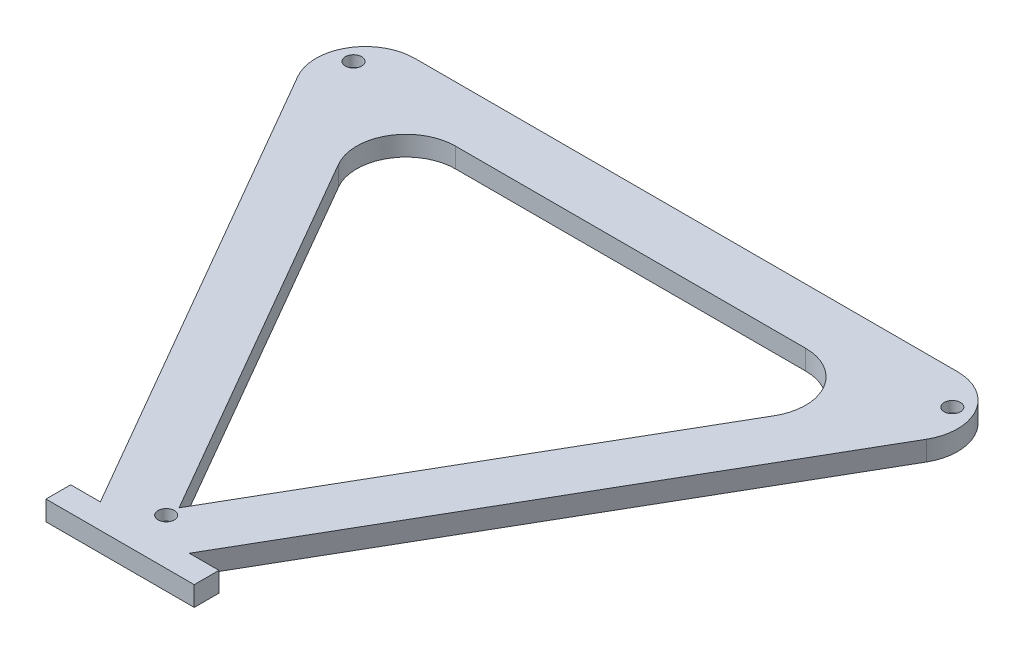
ISO-10303-21;
HEADER;
FILE_DESCRIPTION(('STEP AP214'),'2;1');
FILE_NAME('part.step','',(''),(''),'','','');
FILE_SCHEMA(('AUTOMOTIVE_DESIGN { 1 0 10303 214 1 1 1 1 }'));
ENDSEC;
DATA;
#1=APPLICATION_CONTEXT('core data for automotive mechanical design processes');
#2=APPLICATION_PROTOCOL_DEFINITION('international standard','automotive_design',2000,#1);
#3=PRODUCT_CONTEXT('',#1,'mechanical');
#4=PRODUCT('Part','Part','',(#3));
#5=PRODUCT_RELATED_PRODUCT_CATEGORY('part','',(#4));
#6=PRODUCT_DEFINITION_FORMATION('','',#4);
#7=PRODUCT_DEFINITION_CONTEXT('part definition',#1,'design');
#8=PRODUCT_DEFINITION('design','',#6,#7);
#9=PRODUCT_DEFINITION_SHAPE('','',#8);
#10=(LENGTH_UNIT() NAMED_UNIT(*) SI_UNIT(.MILLI.,.METRE.));
#11=(NAMED_UNIT(*) PLANE_ANGLE_UNIT() SI_UNIT($,.RADIAN.));
#12=(NAMED_UNIT(*) SI_UNIT($,.STERADIAN.) SOLID_ANGLE_UNIT());
#13=UNCERTAINTY_MEASURE_WITH_UNIT(LENGTH_MEASURE(1.E-05),#10,'distance_accuracy_value','');
#14=(GEOMETRIC_REPRESENTATION_CONTEXT(3) GLOBAL_UNCERTAINTY_ASSIGNED_CONTEXT((#13)) GLOBAL_UNIT_ASSIGNED_CONTEXT((#10,
#11,#12)) REPRESENTATION_CONTEXT('',''));
#15=CARTESIAN_POINT('',(0.,0.,0.));
#16=DIRECTION('',(0.,0.,1.));
#17=DIRECTION('',(1.,0.,0.));
#18=AXIS2_PLACEMENT_3D('',#15,#16,#17);
#19=CARTESIAN_POINT('',(13.3772529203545,4.,-25.5556182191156));
#20=DIRECTION('',(0.,1.,0.));
#21=DIRECTION('',(0.,0.,1.));
#22=AXIS2_PLACEMENT_3D('',#19,#20,#21);
#23=PLANE('',#22);
#24=CARTESIAN_POINT('',(-41.5522390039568,4.,69.6664683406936));
#25=DIRECTION('',(0.,1.,0.));
#26=DIRECTION('',(0.,0.,1.));
#27=AXIS2_PLACEMENT_3D('',#24,#25,#26);
#28=CIRCLE('',#27,1.65);
#29=CARTESIAN_POINT('',(-41.5522390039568,4.,71.3164683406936));
#30=VERTEX_POINT('',#29);
#31=EDGE_CURVE('E638',#30,#30,#28,.T.);
#32=ORIENTED_EDGE('',*,*,#31,.F.);
#33=EDGE_LOOP('',(#32));
#34=FACE_BOUND('',#33,.T.);
#35=CARTESIAN_POINT('',(-102.141984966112,4.,-28.8235674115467));
#36=DIRECTION('',(0.,1.,0.));
#37=DIRECTION('',(0.,0.,1.));
#38=AXIS2_PLACEMENT_3D('',#35,#36,#37);
#39=CIRCLE('',#38,1.65);
#40=CARTESIAN_POINT('',(-102.141984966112,4.,-27.1735674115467));
#41=VERTEX_POINT('',#40);
#42=EDGE_CURVE('E641',#41,#41,#39,.T.);
#43=ORIENTED_EDGE('',*,*,#42,.F.);
#44=EDGE_LOOP('',(#43));
#45=FACE_BOUND('',#44,.T.);
#46=CARTESIAN_POINT('',(19.0375069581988,4.,-28.8235674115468));
#47=DIRECTION('',(0.,1.,0.));
#48=DIRECTION('',(0.,0.,1.));
#49=AXIS2_PLACEMENT_3D('',#46,#47,#48);
#50=CIRCLE('',#49,1.65);
#51=CARTESIAN_POINT('',(19.0375069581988,4.,-27.1735674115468));
#52=VERTEX_POINT('',#51);
#53=EDGE_CURVE('E649',#52,#52,#50,.T.);
#54=ORIENTED_EDGE('',*,*,#53,.F.);
#55=EDGE_LOOP('',(#54));
#56=FACE_BOUND('',#55,.T.);
#57=CARTESIAN_POINT('',(13.3772529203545,4.,-25.5556182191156));
#58=DIRECTION('',(0.,1.,0.));
#59=DIRECTION('',(0.,0.,1.));
#60=AXIS2_PLACEMENT_3D('',#57,#58,#59);
#61=CIRCLE('',#60,10.);
#62=CARTESIAN_POINT('',(22.0375069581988,4.,-20.5556182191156));
#63=VERTEX_POINT('',#62);
#64=CARTESIAN_POINT('',(13.3772529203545,4.,-35.5556182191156));
#65=VERTEX_POINT('',#64);
#66=EDGE_CURVE('E254',#63,#65,#61,.T.);
#67=ORIENTED_EDGE('',*,*,#66,.T.);
#68=DIRECTION('',(1.,0.,0.));
#69=VECTOR('',#68,1.);
#70=CARTESIAN_POINT('',(-96.4817309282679,4.,-35.5556182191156));
#71=LINE('',#70,#69);
#72=CARTESIAN_POINT('',(-96.4817309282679,4.,-35.5556182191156));
#73=VERTEX_POINT('',#72);
#74=EDGE_CURVE('E256',#73,#65,#71,.T.);
#75=ORIENTED_EDGE('',*,*,#74,.F.);
#76=CARTESIAN_POINT('',(-96.4817309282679,4.,-25.5556182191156));
#77=DIRECTION('',(0.,1.,0.));
#78=DIRECTION('',(0.,0.,1.));
#79=AXIS2_PLACEMENT_3D('',#76,#77,#78);
#80=CIRCLE('',#79,10.);
#81=CARTESIAN_POINT('',(-105.141984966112,4.,-20.5556182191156));
#82=VERTEX_POINT('',#81);
#83=EDGE_CURVE('E260',#73,#82,#80,.T.);
#84=ORIENTED_EDGE('',*,*,#83,.T.);
#85=DIRECTION('',(-0.5,0.,-0.866025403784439));
#86=VECTOR('',#85,1.);
#87=CARTESIAN_POINT('',(-50.5522390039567,4.,73.9965953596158));
#88=LINE('',#87,#86);
#89=CARTESIAN_POINT('',(-50.5522390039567,4.,73.9965953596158));
#90=VERTEX_POINT('',#89);
#91=EDGE_CURVE('E262',#90,#82,#88,.T.);
#92=ORIENTED_EDGE('',*,*,#91,.F.);
#93=DIRECTION('',(-1.,0.,0.));
#94=VECTOR('',#93,1.);
#95=CARTESIAN_POINT('',(-50.5522390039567,4.,73.9965953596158));
#96=LINE('',#95,#94);
#97=CARTESIAN_POINT('',(-56.5522390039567,4.,73.9965953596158));
#98=VERTEX_POINT('',#97);
#99=EDGE_CURVE('E265',#90,#98,#96,.T.);
#100=ORIENTED_EDGE('',*,*,#99,.T.);
#101=DIRECTION('',(0.,0.,-1.));
#102=VECTOR('',#101,1.);
#103=CARTESIAN_POINT('',(-56.5522390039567,4.,78.9965953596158));
#104=LINE('',#103,#102);
#105=CARTESIAN_POINT('',(-56.5522390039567,4.,78.9965953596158));
#106=VERTEX_POINT('',#105);
#107=EDGE_CURVE('E267',#106,#98,#104,.T.);
#108=ORIENTED_EDGE('',*,*,#107,.F.);
#109=DIRECTION('',(-1.,0.,0.));
#110=VECTOR('',#109,1.);
#111=CARTESIAN_POINT('',(-46.5522390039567,4.,78.9965953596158));
#112=LINE('',#111,#110);
#113=CARTESIAN_POINT('',(-26.5522390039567,4.,78.9965953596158));
#114=VERTEX_POINT('',#113);
#115=EDGE_CURVE('E270',#114,#106,#112,.T.);
#116=ORIENTED_EDGE('',*,*,#115,.F.);
#117=DIRECTION('',(0.,0.,-1.));
#118=VECTOR('',#117,1.);
#119=CARTESIAN_POINT('',(-26.5522390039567,4.,78.9965953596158));
#120=LINE('',#119,#118);
#121=CARTESIAN_POINT('',(-26.5522390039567,4.,73.9965953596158));
#122=VERTEX_POINT('',#121);
#123=EDGE_CURVE('E273',#114,#122,#120,.T.);
#124=ORIENTED_EDGE('',*,*,#123,.T.);
#125=DIRECTION('',(-1.,0.,0.));
#126=VECTOR('',#125,1.);
#127=CARTESIAN_POINT('',(-26.5522390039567,4.,73.9965953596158));
#128=LINE('',#127,#126);
#129=CARTESIAN_POINT('',(-32.5522390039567,4.,73.9965953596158));
#130=VERTEX_POINT('',#129);
#131=EDGE_CURVE('E275',#122,#130,#128,.T.);
#132=ORIENTED_EDGE('',*,*,#131,.T.);
#133=DIRECTION('',(-0.5,0.,0.866025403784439));
#134=VECTOR('',#133,1.);
#135=CARTESIAN_POINT('',(22.0375069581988,4.,-20.5556182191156));
#136=LINE('',#135,#134);
#137=EDGE_CURVE('E277',#63,#130,#136,.T.);
#138=ORIENTED_EDGE('',*,*,#137,.F.);
#139=EDGE_LOOP('',(#67,#75,#84,#92,#100,#108,#116,#124,#132,#138));
#140=FACE_BOUND('',#139,.T.);
#141=DIRECTION('',(1.,0.,0.));
#142=VECTOR('',#141,1.);
#143=CARTESIAN_POINT('',(-76.9817309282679,4.,-24.2972879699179));
#144=LINE('',#143,#142);
#145=CARTESIAN_POINT('',(-76.9817309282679,4.,-24.2972879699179));
#146=VERTEX_POINT('',#145);
#147=CARTESIAN_POINT('',(-6.12274707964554,4.,-24.2972879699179));
#148=VERTEX_POINT('',#147);
#149=EDGE_CURVE('E215',#146,#148,#144,.T.);
#150=ORIENTED_EDGE('',*,*,#149,.T.);
#151=CARTESIAN_POINT('',(-6.12274707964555,4.,-14.2972879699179));
#152=DIRECTION('',(0.,1.,0.));
#153=DIRECTION('',(0.,0.,1.));
#154=AXIS2_PLACEMENT_3D('',#151,#152,#153);
#155=CIRCLE('',#154,10.);
#156=CARTESIAN_POINT('',(2.53750695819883,4.,-9.29728796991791));
#157=VERTEX_POINT('',#156);
#158=EDGE_CURVE('E207',#157,#148,#155,.T.);
#159=ORIENTED_EDGE('',*,*,#158,.F.);
#160=DIRECTION('',(-0.5,0.,0.866025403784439));
#161=VECTOR('',#160,1.);
#162=CARTESIAN_POINT('',(2.53750695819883,4.,-9.29728796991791));
#163=LINE('',#162,#161);
#164=CARTESIAN_POINT('',(-41.5522390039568,4.,67.0683921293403));
#165=VERTEX_POINT('',#164);
#166=EDGE_CURVE('E235',#157,#165,#163,.T.);
#167=ORIENTED_EDGE('',*,*,#166,.T.);
#168=DIRECTION('',(-0.5,0.,-0.866025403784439));
#169=VECTOR('',#168,1.);
#170=CARTESIAN_POINT('',(-41.5522390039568,4.,67.0683921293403));
#171=LINE('',#170,#169);
#172=CARTESIAN_POINT('',(-85.6419849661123,4.,-9.29728796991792));
#173=VERTEX_POINT('',#172);
#174=EDGE_CURVE('E115',#165,#173,#171,.T.);
#175=ORIENTED_EDGE('',*,*,#174,.T.);
#176=CARTESIAN_POINT('',(-76.9817309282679,4.,-14.2972879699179));
#177=DIRECTION('',(0.,1.,0.));
#178=DIRECTION('',(0.,0.,1.));
#179=AXIS2_PLACEMENT_3D('',#176,#177,#178);
#180=CIRCLE('',#179,10.);
#181=EDGE_CURVE('E229',#146,#173,#180,.T.);
#182=ORIENTED_EDGE('',*,*,#181,.F.);
#183=EDGE_LOOP('',(#150,#159,#167,#175,#182));
#184=FACE_BOUND('',#183,.T.);
#185=ADVANCED_FACE('F100',(#34,#45,#56,#140,#184),#23,.T.);
#186=CARTESIAN_POINT('',(13.3772529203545,0.,-25.5556182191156));
#187=DIRECTION('',(0.,1.,0.));
#188=DIRECTION('',(0.,0.,1.));
#189=AXIS2_PLACEMENT_3D('',#186,#187,#188);
#190=PLANE('',#189);
#191=CARTESIAN_POINT('',(13.3772529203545,0.,-25.5556182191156));
#192=DIRECTION('',(0.,1.,0.));
#193=DIRECTION('',(0.,0.,1.));
#194=AXIS2_PLACEMENT_3D('',#191,#192,#193);
#195=CIRCLE('',#194,10.);
#196=CARTESIAN_POINT('',(22.0375069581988,0.,-20.5556182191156));
#197=VERTEX_POINT('',#196);
#198=CARTESIAN_POINT('',(13.3772529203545,0.,-35.5556182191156));
#199=VERTEX_POINT('',#198);
#200=EDGE_CURVE('E226',#197,#199,#195,.T.);
#201=ORIENTED_EDGE('',*,*,#200,.F.);
#202=DIRECTION('',(-0.5,0.,0.866025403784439));
#203=VECTOR('',#202,1.);
#204=CARTESIAN_POINT('',(22.0375069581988,0.,-20.5556182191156));
#205=LINE('',#204,#203);
#206=CARTESIAN_POINT('',(-32.5522390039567,0.,73.9965953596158));
#207=VERTEX_POINT('',#206);
#208=EDGE_CURVE('E257',#197,#207,#205,.T.);
#209=ORIENTED_EDGE('',*,*,#208,.T.);
#210=DIRECTION('',(-1.,0.,0.));
#211=VECTOR('',#210,1.);
#212=CARTESIAN_POINT('',(-26.5522390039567,0.,73.9965953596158));
#213=LINE('',#212,#211);
#214=CARTESIAN_POINT('',(-26.5522390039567,0.,73.9965953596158));
#215=VERTEX_POINT('',#214);
#216=EDGE_CURVE('E302',#215,#207,#213,.T.);
#217=ORIENTED_EDGE('',*,*,#216,.F.);
#218=DIRECTION('',(0.,0.,-1.));
#219=VECTOR('',#218,1.);
#220=CARTESIAN_POINT('',(-26.5522390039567,0.,78.9965953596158));
#221=LINE('',#220,#219);
#222=CARTESIAN_POINT('',(-26.5522390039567,0.,78.9965953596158));
#223=VERTEX_POINT('',#222);
#224=EDGE_CURVE('E300',#223,#215,#221,.T.);
#225=ORIENTED_EDGE('',*,*,#224,.F.);
#226=DIRECTION('',(-1.,0.,0.));
#227=VECTOR('',#226,1.);
#228=CARTESIAN_POINT('',(-26.5522390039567,0.,78.9965953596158));
#229=LINE('',#228,#227);
#230=CARTESIAN_POINT('',(-56.5522390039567,0.,78.9965953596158));
#231=VERTEX_POINT('',#230);
#232=EDGE_CURVE('E298',#223,#231,#229,.T.);
#233=ORIENTED_EDGE('',*,*,#232,.T.);
#234=DIRECTION('',(0.,0.,-1.));
#235=VECTOR('',#234,1.);
#236=CARTESIAN_POINT('',(-56.5522390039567,0.,78.9965953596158));
#237=LINE('',#236,#235);
#238=CARTESIAN_POINT('',(-56.5522390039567,0.,73.9965953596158));
#239=VERTEX_POINT('',#238);
#240=EDGE_CURVE('E295',#231,#239,#237,.T.);
#241=ORIENTED_EDGE('',*,*,#240,.T.);
#242=DIRECTION('',(-1.,0.,0.));
#243=VECTOR('',#242,1.);
#244=CARTESIAN_POINT('',(-50.5522390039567,0.,73.9965953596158));
#245=LINE('',#244,#243);
#246=CARTESIAN_POINT('',(-50.5522390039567,0.,73.9965953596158));
#247=VERTEX_POINT('',#246);
#248=EDGE_CURVE('E292',#247,#239,#245,.T.);
#249=ORIENTED_EDGE('',*,*,#248,.F.);
#250=DIRECTION('',(-0.5,0.,-0.866025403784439));
#251=VECTOR('',#250,1.);
#252=CARTESIAN_POINT('',(-50.5522390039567,0.,73.9965953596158));
#253=LINE('',#252,#251);
#254=CARTESIAN_POINT('',(-105.141984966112,0.,-20.5556182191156));
#255=VERTEX_POINT('',#254);
#256=EDGE_CURVE('E289',#247,#255,#253,.T.);
#257=ORIENTED_EDGE('',*,*,#256,.T.);
#258=CARTESIAN_POINT('',(-96.4817309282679,0.,-25.5556182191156));
#259=DIRECTION('',(0.,1.,0.));
#260=DIRECTION('',(0.,0.,1.));
#261=AXIS2_PLACEMENT_3D('',#258,#259,#260);
#262=CIRCLE('',#261,10.);
#263=CARTESIAN_POINT('',(-96.4817309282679,0.,-35.5556182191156));
#264=VERTEX_POINT('',#263);
#265=EDGE_CURVE('E286',#264,#255,#262,.T.);
#266=ORIENTED_EDGE('',*,*,#265,.F.);
#267=DIRECTION('',(1.,0.,0.));
#268=VECTOR('',#267,1.);
#269=CARTESIAN_POINT('',(-96.4817309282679,0.,-35.5556182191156));
#270=LINE('',#269,#268);
#271=EDGE_CURVE('E283',#264,#199,#270,.T.);
#272=ORIENTED_EDGE('',*,*,#271,.T.);
#273=EDGE_LOOP('',(#201,#209,#217,#225,#233,#241,#249,#257,#266,#272));
#274=FACE_BOUND('',#273,.T.);
#275=CARTESIAN_POINT('',(-6.12274707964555,0.,-14.2972879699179));
#276=DIRECTION('',(0.,1.,0.));
#277=DIRECTION('',(0.,0.,1.));
#278=AXIS2_PLACEMENT_3D('',#275,#276,#277);
#279=CIRCLE('',#278,10.);
#280=CARTESIAN_POINT('',(2.53750695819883,0.,-9.29728796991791));
#281=VERTEX_POINT('',#280);
#282=CARTESIAN_POINT('',(-6.12274707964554,0.,-24.2972879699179));
#283=VERTEX_POINT('',#282);
#284=EDGE_CURVE('E237',#281,#283,#279,.T.);
#285=ORIENTED_EDGE('',*,*,#284,.T.);
#286=DIRECTION('',(1.,0.,0.));
#287=VECTOR('',#286,1.);
#288=CARTESIAN_POINT('',(-76.9817309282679,0.,-24.2972879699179));
#289=LINE('',#288,#287);
#290=CARTESIAN_POINT('',(-76.9817309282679,0.,-24.2972879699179));
#291=VERTEX_POINT('',#290);
#292=EDGE_CURVE('E224',#291,#283,#289,.T.);
#293=ORIENTED_EDGE('',*,*,#292,.F.);
#294=CARTESIAN_POINT('',(-76.9817309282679,0.,-14.2972879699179));
#295=DIRECTION('',(0.,1.,0.));
#296=DIRECTION('',(0.,0.,1.));
#297=AXIS2_PLACEMENT_3D('',#294,#295,#296);
#298=CIRCLE('',#297,10.0000000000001);
#299=CARTESIAN_POINT('',(-85.6419849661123,0.,-9.29728796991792));
#300=VERTEX_POINT('',#299);
#301=EDGE_CURVE('E241',#291,#300,#298,.T.);
#302=ORIENTED_EDGE('',*,*,#301,.T.);
#303=DIRECTION('',(-0.5,0.,-0.866025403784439));
#304=VECTOR('',#303,1.);
#305=CARTESIAN_POINT('',(-41.5522390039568,0.,67.0683921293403));
#306=LINE('',#305,#304);
#307=CARTESIAN_POINT('',(-41.5522390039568,0.,67.0683921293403));
#308=VERTEX_POINT('',#307);
#309=EDGE_CURVE('E244',#308,#300,#306,.T.);
#310=ORIENTED_EDGE('',*,*,#309,.F.);
#311=DIRECTION('',(-0.5,0.,0.866025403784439));
#312=VECTOR('',#311,1.);
#313=CARTESIAN_POINT('',(2.53750695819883,0.,-9.29728796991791));
#314=LINE('',#313,#312);
#315=EDGE_CURVE('E216',#281,#308,#314,.T.);
#316=ORIENTED_EDGE('',*,*,#315,.F.);
#317=EDGE_LOOP('',(#285,#293,#302,#310,#316));
#318=FACE_BOUND('',#317,.T.);
#319=ADVANCED_FACE('F335',(#274,#318),#190,.F.);
#320=CARTESIAN_POINT('',(13.3772529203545,4.,-25.5556182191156));
#321=DIRECTION('',(0.,-1.,0.));
#322=DIRECTION('',(0.,0.,-1.));
#323=AXIS2_PLACEMENT_3D('',#320,#321,#322);
#324=CYLINDRICAL_SURFACE('',#323,10.);
#325=ORIENTED_EDGE('',*,*,#200,.T.);
#326=DIRECTION('',(0.,-1.,0.));
#327=VECTOR('',#326,1.);
#328=CARTESIAN_POINT('',(13.3772529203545,4.,-35.5556182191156));
#329=LINE('',#328,#327);
#330=EDGE_CURVE('E12',#65,#199,#329,.T.);
#331=ORIENTED_EDGE('',*,*,#330,.F.);
#332=ORIENTED_EDGE('',*,*,#66,.F.);
#333=DIRECTION('',(0.,-1.,0.));
#334=VECTOR('',#333,1.);
#335=CARTESIAN_POINT('',(22.0375069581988,4.,-20.5556182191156));
#336=LINE('',#335,#334);
#337=EDGE_CURVE('E280',#63,#197,#336,.T.);
#338=ORIENTED_EDGE('',*,*,#337,.T.);
#339=EDGE_LOOP('',(#325,#331,#332,#338));
#340=FACE_BOUND('',#339,.T.);
#341=ADVANCED_FACE('F102',(#340),#324,.T.);
#342=CARTESIAN_POINT('',(-96.4817309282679,4.,-35.5556182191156));
#343=DIRECTION('',(0.,0.,-1.));
#344=DIRECTION('',(-1.,0.,0.));
#345=AXIS2_PLACEMENT_3D('',#342,#343,#344);
#346=PLANE('',#345);
#347=ORIENTED_EDGE('',*,*,#271,.F.);
#348=DIRECTION('',(0.,-1.,0.));
#349=VECTOR('',#348,1.);
#350=CARTESIAN_POINT('',(-96.4817309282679,4.,-35.5556182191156));
#351=LINE('',#350,#349);
#352=EDGE_CURVE('E108',#73,#264,#351,.T.);
#353=ORIENTED_EDGE('',*,*,#352,.F.);
#354=ORIENTED_EDGE('',*,*,#74,.T.);
#355=ORIENTED_EDGE('',*,*,#330,.T.);
#356=EDGE_LOOP('',(#347,#353,#354,#355));
#357=FACE_BOUND('',#356,.T.);
#358=ADVANCED_FACE('F332',(#357),#346,.T.);
#359=CARTESIAN_POINT('',(-96.4817309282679,4.,-25.5556182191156));
#360=DIRECTION('',(0.,-1.,0.));
#361=DIRECTION('',(0.,0.,-1.));
#362=AXIS2_PLACEMENT_3D('',#359,#360,#361);
#363=CYLINDRICAL_SURFACE('',#362,10.);
#364=ORIENTED_EDGE('',*,*,#265,.T.);
#365=DIRECTION('',(0.,-1.,0.));
#366=VECTOR('',#365,1.);
#367=CARTESIAN_POINT('',(-105.141984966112,4.,-20.5556182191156));
#368=LINE('',#367,#366);
#369=EDGE_CURVE('E323',#82,#255,#368,.T.);
#370=ORIENTED_EDGE('',*,*,#369,.F.);
#371=ORIENTED_EDGE('',*,*,#83,.F.);
#372=ORIENTED_EDGE('',*,*,#352,.T.);
#373=EDGE_LOOP('',(#364,#370,#371,#372));
#374=FACE_BOUND('',#373,.T.);
#375=ADVANCED_FACE('F328',(#374),#363,.T.);
#376=CARTESIAN_POINT('',(-50.5522390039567,4.,73.9965953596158));
#377=DIRECTION('',(-0.866025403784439,0.,0.5));
#378=DIRECTION('',(0.5,0.,0.866025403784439));
#379=AXIS2_PLACEMENT_3D('',#376,#377,#378);
#380=PLANE('',#379);
#381=ORIENTED_EDGE('',*,*,#256,.F.);
#382=DIRECTION('',(0.,-1.,0.));
#383=VECTOR('',#382,1.);
#384=CARTESIAN_POINT('',(-50.5522390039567,4.,73.9965953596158));
#385=LINE('',#384,#383);
#386=EDGE_CURVE('E321',#90,#247,#385,.T.);
#387=ORIENTED_EDGE('',*,*,#386,.F.);
#388=ORIENTED_EDGE('',*,*,#91,.T.);
#389=ORIENTED_EDGE('',*,*,#369,.T.);
#390=EDGE_LOOP('',(#381,#387,#388,#389));
#391=FACE_BOUND('',#390,.T.);
#392=ADVANCED_FACE('F340',(#391),#380,.T.);
#393=CARTESIAN_POINT('',(-50.5522390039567,4.,73.9965953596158));
#394=DIRECTION('',(0.,0.,1.));
#395=DIRECTION('',(1.,0.,0.));
#396=AXIS2_PLACEMENT_3D('',#393,#394,#395);
#397=PLANE('',#396);
#398=ORIENTED_EDGE('',*,*,#248,.T.);
#399=DIRECTION('',(0.,-1.,0.));
#400=VECTOR('',#399,1.);
#401=CARTESIAN_POINT('',(-56.5522390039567,4.,73.9965953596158));
#402=LINE('',#401,#400);
#403=EDGE_CURVE('E319',#98,#239,#402,.T.);
#404=ORIENTED_EDGE('',*,*,#403,.F.);
#405=ORIENTED_EDGE('',*,*,#99,.F.);
#406=ORIENTED_EDGE('',*,*,#386,.T.);
#407=EDGE_LOOP('',(#398,#404,#405,#406));
#408=FACE_BOUND('',#407,.T.);
#409=ADVANCED_FACE('F370',(#408),#397,.F.);
#410=CARTESIAN_POINT('',(-56.5522390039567,4.,78.9965953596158));
#411=DIRECTION('',(-1.,0.,0.));
#412=DIRECTION('',(0.,0.,1.));
#413=AXIS2_PLACEMENT_3D('',#410,#411,#412);
#414=PLANE('',#413);
#415=ORIENTED_EDGE('',*,*,#240,.F.);
#416=DIRECTION('',(0.,-1.,0.));
#417=VECTOR('',#416,1.);
#418=CARTESIAN_POINT('',(-56.5522390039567,4.,78.9965953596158));
#419=LINE('',#418,#417);
#420=EDGE_CURVE('E316',#106,#231,#419,.T.);
#421=ORIENTED_EDGE('',*,*,#420,.F.);
#422=ORIENTED_EDGE('',*,*,#107,.T.);
#423=ORIENTED_EDGE('',*,*,#403,.T.);
#424=EDGE_LOOP('',(#415,#421,#422,#423));
#425=FACE_BOUND('',#424,.T.);
#426=ADVANCED_FACE('F368',(#425),#414,.T.);
#427=CARTESIAN_POINT('',(-26.5522390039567,4.,78.9965953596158));
#428=DIRECTION('',(0.,0.,1.));
#429=DIRECTION('',(1.,0.,0.));
#430=AXIS2_PLACEMENT_3D('',#427,#428,#429);
#431=PLANE('',#430);
#432=ORIENTED_EDGE('',*,*,#232,.F.);
#433=DIRECTION('',(0.,-1.,0.));
#434=VECTOR('',#433,1.);
#435=CARTESIAN_POINT('',(-26.5522390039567,4.,78.9965953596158));
#436=LINE('',#435,#434);
#437=EDGE_CURVE('E314',#114,#223,#436,.T.);
#438=ORIENTED_EDGE('',*,*,#437,.F.);
#439=ORIENTED_EDGE('',*,*,#115,.T.);
#440=ORIENTED_EDGE('',*,*,#420,.T.);
#441=EDGE_LOOP('',(#432,#438,#439,#440));
#442=FACE_BOUND('',#441,.T.);
#443=ADVANCED_FACE('F365',(#442),#431,.T.);
#444=CARTESIAN_POINT('',(-26.5522390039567,4.,78.9965953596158));
#445=DIRECTION('',(-1.,0.,0.));
#446=DIRECTION('',(0.,0.,1.));
#447=AXIS2_PLACEMENT_3D('',#444,#445,#446);
#448=PLANE('',#447);
#449=ORIENTED_EDGE('',*,*,#224,.T.);
#450=DIRECTION('',(0.,-1.,0.));
#451=VECTOR('',#450,1.);
#452=CARTESIAN_POINT('',(-26.5522390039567,4.,73.9965953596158));
#453=LINE('',#452,#451);
#454=EDGE_CURVE('E311',#122,#215,#453,.T.);
#455=ORIENTED_EDGE('',*,*,#454,.F.);
#456=ORIENTED_EDGE('',*,*,#123,.F.);
#457=ORIENTED_EDGE('',*,*,#437,.T.);
#458=EDGE_LOOP('',(#449,#455,#456,#457));
#459=FACE_BOUND('',#458,.T.);
#460=ADVANCED_FACE('F362',(#459),#448,.F.);
#461=CARTESIAN_POINT('',(-26.5522390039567,4.,73.9965953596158));
#462=DIRECTION('',(0.,0.,1.));
#463=DIRECTION('',(1.,0.,0.));
#464=AXIS2_PLACEMENT_3D('',#461,#462,#463);
#465=PLANE('',#464);
#466=ORIENTED_EDGE('',*,*,#216,.T.);
#467=DIRECTION('',(0.,-1.,0.));
#468=VECTOR('',#467,1.);
#469=CARTESIAN_POINT('',(-32.5522390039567,4.,73.9965953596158));
#470=LINE('',#469,#468);
#471=EDGE_CURVE('E309',#130,#207,#470,.T.);
#472=ORIENTED_EDGE('',*,*,#471,.F.);
#473=ORIENTED_EDGE('',*,*,#131,.F.);
#474=ORIENTED_EDGE('',*,*,#454,.T.);
#475=EDGE_LOOP('',(#466,#472,#473,#474));
#476=FACE_BOUND('',#475,.T.);
#477=ADVANCED_FACE('F357',(#476),#465,.F.);
#478=CARTESIAN_POINT('',(22.0375069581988,4.,-20.5556182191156));
#479=DIRECTION('',(0.866025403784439,0.,0.5));
#480=DIRECTION('',(0.5,0.,-0.866025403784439));
#481=AXIS2_PLACEMENT_3D('',#478,#479,#480);
#482=PLANE('',#481);
#483=ORIENTED_EDGE('',*,*,#208,.F.);
#484=ORIENTED_EDGE('',*,*,#337,.F.);
#485=ORIENTED_EDGE('',*,*,#137,.T.);
#486=ORIENTED_EDGE('',*,*,#471,.T.);
#487=EDGE_LOOP('',(#483,#484,#485,#486));
#488=FACE_BOUND('',#487,.T.);
#489=ADVANCED_FACE('F351',(#488),#482,.T.);
#490=CARTESIAN_POINT('',(-6.12274707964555,4.,-14.2972879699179));
#491=DIRECTION('',(0.,-1.,0.));
#492=DIRECTION('',(0.,0.,-1.));
#493=AXIS2_PLACEMENT_3D('',#490,#491,#492);
#494=CYLINDRICAL_SURFACE('',#493,10.);
#495=ORIENTED_EDGE('',*,*,#284,.F.);
#496=DIRECTION('',(0.,-1.,0.));
#497=VECTOR('',#496,1.);
#498=CARTESIAN_POINT('',(2.53750695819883,4.,-9.29728796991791));
#499=LINE('',#498,#497);
#500=EDGE_CURVE('E123',#157,#281,#499,.T.);
#501=ORIENTED_EDGE('',*,*,#500,.F.);
#502=ORIENTED_EDGE('',*,*,#158,.T.);
#503=DIRECTION('',(0.,-1.,0.));
#504=VECTOR('',#503,1.);
#505=CARTESIAN_POINT('',(-6.12274707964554,4.,-24.2972879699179));
#506=LINE('',#505,#504);
#507=EDGE_CURVE('E210',#148,#283,#506,.T.);
#508=ORIENTED_EDGE('',*,*,#507,.T.);
#509=EDGE_LOOP('',(#495,#501,#502,#508));
#510=FACE_BOUND('',#509,.T.);
#511=ADVANCED_FACE('F209',(#510),#494,.F.);
#512=CARTESIAN_POINT('',(-76.9817309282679,4.,-24.2972879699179));
#513=DIRECTION('',(0.,0.,-1.));
#514=DIRECTION('',(-1.,0.,0.));
#515=AXIS2_PLACEMENT_3D('',#512,#513,#514);
#516=PLANE('',#515);
#517=ORIENTED_EDGE('',*,*,#292,.T.);
#518=ORIENTED_EDGE('',*,*,#507,.F.);
#519=ORIENTED_EDGE('',*,*,#149,.F.);
#520=DIRECTION('',(0.,-1.,0.));
#521=VECTOR('',#520,1.);
#522=CARTESIAN_POINT('',(-76.9817309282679,4.,-24.2972879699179));
#523=LINE('',#522,#521);
#524=EDGE_CURVE('E227',#146,#291,#523,.T.);
#525=ORIENTED_EDGE('',*,*,#524,.T.);
#526=EDGE_LOOP('',(#517,#518,#519,#525));
#527=FACE_BOUND('',#526,.T.);
#528=ADVANCED_FACE('F220',(#527),#516,.F.);
#529=CARTESIAN_POINT('',(-76.9817309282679,4.,-14.2972879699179));
#530=DIRECTION('',(0.,-1.,0.));
#531=DIRECTION('',(0.,0.,-1.));
#532=AXIS2_PLACEMENT_3D('',#529,#530,#531);
#533=CYLINDRICAL_SURFACE('',#532,10.0000000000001);
#534=ORIENTED_EDGE('',*,*,#301,.F.);
#535=ORIENTED_EDGE('',*,*,#524,.F.);
#536=ORIENTED_EDGE('',*,*,#181,.T.);
#537=DIRECTION('',(0.,-1.,0.));
#538=VECTOR('',#537,1.);
#539=CARTESIAN_POINT('',(-85.6419849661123,4.,-9.29728796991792));
#540=LINE('',#539,#538);
#541=EDGE_CURVE('E251',#173,#300,#540,.T.);
#542=ORIENTED_EDGE('',*,*,#541,.T.);
#543=EDGE_LOOP('',(#534,#535,#536,#542));
#544=FACE_BOUND('',#543,.T.);
#545=ADVANCED_FACE('F425',(#544),#533,.F.);
#546=CARTESIAN_POINT('',(-41.5522390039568,4.,67.0683921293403));
#547=DIRECTION('',(-0.866025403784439,0.,0.5));
#548=DIRECTION('',(0.5,0.,0.866025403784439));
#549=AXIS2_PLACEMENT_3D('',#546,#547,#548);
#550=PLANE('',#549);
#551=ORIENTED_EDGE('',*,*,#309,.T.);
#552=ORIENTED_EDGE('',*,*,#541,.F.);
#553=ORIENTED_EDGE('',*,*,#174,.F.);
#554=DIRECTION('',(0.,-1.,0.));
#555=VECTOR('',#554,1.);
#556=CARTESIAN_POINT('',(-41.5522390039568,4.,67.0683921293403));
#557=LINE('',#556,#555);
#558=EDGE_CURVE('E249',#165,#308,#557,.T.);
#559=ORIENTED_EDGE('',*,*,#558,.T.);
#560=EDGE_LOOP('',(#551,#552,#553,#559));
#561=FACE_BOUND('',#560,.T.);
#562=ADVANCED_FACE('F431',(#561),#550,.F.);
#563=CARTESIAN_POINT('',(2.53750695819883,4.,-9.29728796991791));
#564=DIRECTION('',(0.866025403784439,0.,0.5));
#565=DIRECTION('',(0.5,0.,-0.866025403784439));
#566=AXIS2_PLACEMENT_3D('',#563,#564,#565);
#567=PLANE('',#566);
#568=ORIENTED_EDGE('',*,*,#315,.T.);
#569=ORIENTED_EDGE('',*,*,#558,.F.);
#570=ORIENTED_EDGE('',*,*,#166,.F.);
#571=ORIENTED_EDGE('',*,*,#500,.T.);
#572=EDGE_LOOP('',(#568,#569,#570,#571));
#573=FACE_BOUND('',#572,.T.);
#574=ADVANCED_FACE('F439',(#573),#567,.F.);
#575=CARTESIAN_POINT('',(19.0375069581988,1.8,-28.8235674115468));
#576=DIRECTION('',(0.,1.,0.));
#577=DIRECTION('',(0.,0.,1.));
#578=AXIS2_PLACEMENT_3D('',#575,#576,#577);
#579=CYLINDRICAL_SURFACE('',#578,1.65);
#580=CARTESIAN_POINT('',(19.0375069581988,1.8,-28.8235674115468));
#581=DIRECTION('',(0.,1.,0.));
#582=DIRECTION('',(0.,0.,1.));
#583=AXIS2_PLACEMENT_3D('',#580,#581,#582);
#584=CIRCLE('',#583,1.65);
#585=CARTESIAN_POINT('',(19.0375069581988,1.8,-27.1735674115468));
#586=VERTEX_POINT('',#585);
#587=EDGE_CURVE('E651',#586,#586,#584,.T.);
#588=ORIENTED_EDGE('',*,*,#587,.F.);
#589=EDGE_LOOP('',(#588));
#590=FACE_BOUND('',#589,.T.);
#591=ORIENTED_EDGE('',*,*,#53,.T.);
#592=EDGE_LOOP('',(#591));
#593=FACE_BOUND('',#592,.T.);
#594=ADVANCED_FACE('F446',(#590,#593),#579,.F.);
#595=CARTESIAN_POINT('',(19.0375069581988,1.8,-28.8235674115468));
#596=DIRECTION('',(0.,1.,0.));
#597=DIRECTION('',(0.,0.,1.));
#598=AXIS2_PLACEMENT_3D('',#595,#596,#597);
#599=PLANE('',#598);
#600=ORIENTED_EDGE('',*,*,#587,.T.);
#601=EDGE_LOOP('',(#600));
#602=FACE_BOUND('',#601,.T.);
#603=ADVANCED_FACE('F453',(#602),#599,.T.);
#604=CARTESIAN_POINT('',(-102.141984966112,1.8,-28.8235674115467));
#605=DIRECTION('',(0.,1.,0.));
#606=DIRECTION('',(0.,0.,1.));
#607=AXIS2_PLACEMENT_3D('',#604,#605,#606);
#608=CYLINDRICAL_SURFACE('',#607,1.65);
#609=CARTESIAN_POINT('',(-102.141984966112,1.8,-28.8235674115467));
#610=DIRECTION('',(0.,1.,0.));
#611=DIRECTION('',(0.,0.,1.));
#612=AXIS2_PLACEMENT_3D('',#609,#610,#611);
#613=CIRCLE('',#612,1.65);
#614=CARTESIAN_POINT('',(-102.141984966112,1.8,-27.1735674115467));
#615=VERTEX_POINT('',#614);
#616=EDGE_CURVE('E646',#615,#615,#613,.T.);
#617=ORIENTED_EDGE('',*,*,#616,.F.);
#618=EDGE_LOOP('',(#617));
#619=FACE_BOUND('',#618,.T.);
#620=ORIENTED_EDGE('',*,*,#42,.T.);
#621=EDGE_LOOP('',(#620));
#622=FACE_BOUND('',#621,.T.);
#623=ADVANCED_FACE('F461',(#619,#622),#608,.F.);
#624=CARTESIAN_POINT('',(-102.141984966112,1.8,-28.8235674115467));
#625=DIRECTION('',(0.,1.,0.));
#626=DIRECTION('',(0.,0.,1.));
#627=AXIS2_PLACEMENT_3D('',#624,#625,#626);
#628=PLANE('',#627);
#629=ORIENTED_EDGE('',*,*,#616,.T.);
#630=EDGE_LOOP('',(#629));
#631=FACE_BOUND('',#630,.T.);
#632=ADVANCED_FACE('F469',(#631),#628,.T.);
#633=CARTESIAN_POINT('',(-41.5522390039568,1.8,69.6664683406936));
#634=DIRECTION('',(0.,1.,0.));
#635=DIRECTION('',(0.,0.,1.));
#636=AXIS2_PLACEMENT_3D('',#633,#634,#635);
#637=CYLINDRICAL_SURFACE('',#636,1.65);
#638=CARTESIAN_POINT('',(-41.5522390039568,1.8,69.6664683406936));
#639=DIRECTION('',(0.,1.,0.));
#640=DIRECTION('',(0.,0.,1.));
#641=AXIS2_PLACEMENT_3D('',#638,#639,#640);
#642=CIRCLE('',#641,1.65);
#643=CARTESIAN_POINT('',(-41.5522390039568,1.8,71.3164683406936));
#644=VERTEX_POINT('',#643);
#645=EDGE_CURVE('E239',#644,#644,#642,.T.);
#646=ORIENTED_EDGE('',*,*,#645,.F.);
#647=EDGE_LOOP('',(#646));
#648=FACE_BOUND('',#647,.T.);
#649=ORIENTED_EDGE('',*,*,#31,.T.);
#650=EDGE_LOOP('',(#649));
#651=FACE_BOUND('',#650,.T.);
#652=ADVANCED_FACE('F477',(#648,#651),#637,.F.);
#653=CARTESIAN_POINT('',(-41.5522390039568,1.8,69.6664683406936));
#654=DIRECTION('',(0.,1.,0.));
#655=DIRECTION('',(0.,0.,1.));
#656=AXIS2_PLACEMENT_3D('',#653,#654,#655);
#657=PLANE('',#656);
#658=ORIENTED_EDGE('',*,*,#645,.T.);
#659=EDGE_LOOP('',(#658));
#660=FACE_BOUND('',#659,.T.);
#661=ADVANCED_FACE('F485',(#660),#657,.T.);
#662=CLOSED_SHELL('',(#185,#319,#341,#358,#375,#392,#409,#426,#443,#460,#477,#489,#511,#528,
#545,#562,#574,#594,#603,#623,#632,#652,#661));
#663=MANIFOLD_SOLID_BREP('B2',#662);
#664=ADVANCED_BREP_SHAPE_REPRESENTATION('',(#18,#663),#14);
#665=SHAPE_DEFINITION_REPRESENTATION(#9,#664);
ENDSEC;
END-ISO-10303-21;
